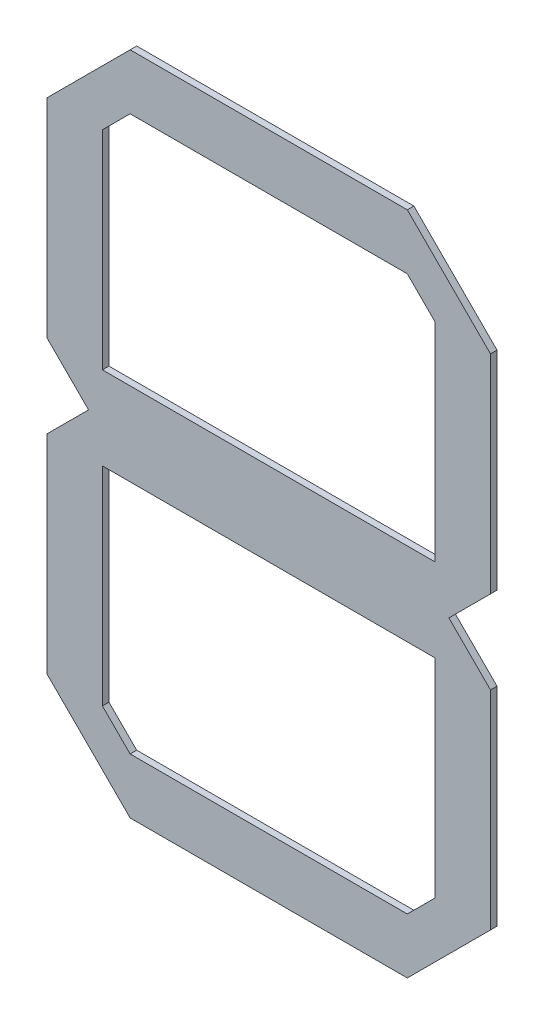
from build123d import *

# Parameters (mm, degrees)
BOSS_EXTRUDE1_DEPTH = 6


with BuildPart() as part:
    # Sketch1 → Boss-Extrude1 (new body)
    with BuildSketch(Plane.XY):
        Polygon((-203.2, 38.1), (-203.2, 228.6), (-127, 304.8), (127, 304.8), (203.2, 228.6), (203.2, 38.1), (165.1, 0), (203.2, -38.1), (203.2, -228.6), (127, -304.8), (-127, -304.8), (-203.2, -228.6), (-203.2, -38.1), (-165.1, 0), align=None)
        Polygon((-152.4, 38.1), (-152.4, 228.6), (-127, 254), (0, 254), (127, 254), (152.4, 228.6), (152.4, 38.1), align=None, mode=Mode.SUBTRACT)
        Polygon((127, -254), (152.4, -228.6), (152.4, -38.1), (-152.4, -38.1), (-152.4, -228.6), (-127, -254), (0, -254), align=None, mode=Mode.SUBTRACT)
    extrude(amount=-BOSS_EXTRUDE1_DEPTH)


solid = part.part
